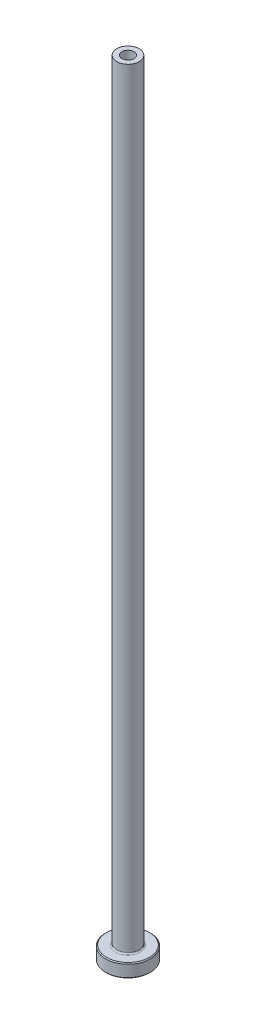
ISO-10303-21;
HEADER;
FILE_DESCRIPTION(('STEP AP214'),'2;1');
FILE_NAME('part.step','',(''),(''),'','','');
FILE_SCHEMA(('AUTOMOTIVE_DESIGN { 1 0 10303 214 1 1 1 1 }'));
ENDSEC;
DATA;
#1=APPLICATION_CONTEXT('core data for automotive mechanical design processes');
#2=APPLICATION_PROTOCOL_DEFINITION('international standard','automotive_design',2000,#1);
#3=PRODUCT_CONTEXT('',#1,'mechanical');
#4=PRODUCT('Part','Part','',(#3));
#5=PRODUCT_RELATED_PRODUCT_CATEGORY('part','',(#4));
#6=PRODUCT_DEFINITION_FORMATION('','',#4);
#7=PRODUCT_DEFINITION_CONTEXT('part definition',#1,'design');
#8=PRODUCT_DEFINITION('design','',#6,#7);
#9=PRODUCT_DEFINITION_SHAPE('','',#8);
#10=(LENGTH_UNIT() NAMED_UNIT(*) SI_UNIT(.MILLI.,.METRE.));
#11=(NAMED_UNIT(*) PLANE_ANGLE_UNIT() SI_UNIT($,.RADIAN.));
#12=(NAMED_UNIT(*) SI_UNIT($,.STERADIAN.) SOLID_ANGLE_UNIT());
#13=UNCERTAINTY_MEASURE_WITH_UNIT(LENGTH_MEASURE(1.E-05),#10,'distance_accuracy_value','');
#14=(GEOMETRIC_REPRESENTATION_CONTEXT(3) GLOBAL_UNCERTAINTY_ASSIGNED_CONTEXT((#13)) GLOBAL_UNIT_ASSIGNED_CONTEXT((#10,
#11,#12)) REPRESENTATION_CONTEXT('',''));
#15=CARTESIAN_POINT('',(0.,0.,0.));
#16=DIRECTION('',(0.,0.,1.));
#17=DIRECTION('',(1.,0.,0.));
#18=AXIS2_PLACEMENT_3D('',#15,#16,#17);
#19=CARTESIAN_POINT('',(0.,92.1876809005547,0.));
#20=DIRECTION('',(0.,1.,0.));
#21=DIRECTION('',(0.,0.,1.));
#22=AXIS2_PLACEMENT_3D('',#19,#20,#21);
#23=CYLINDRICAL_SURFACE('',#22,1.35);
#24=CARTESIAN_POINT('',(0.,175.,0.));
#25=DIRECTION('',(0.,1.,0.));
#26=DIRECTION('',(0.,0.,1.));
#27=AXIS2_PLACEMENT_3D('',#24,#25,#26);
#28=CIRCLE('',#27,1.35);
#29=CARTESIAN_POINT('',(0.,175.,1.35));
#30=VERTEX_POINT('',#29);
#31=EDGE_CURVE('E62',#30,#30,#28,.T.);
#32=ORIENTED_EDGE('',*,*,#31,.T.);
#33=EDGE_LOOP('',(#32));
#34=FACE_BOUND('',#33,.T.);
#35=CARTESIAN_POINT('',(0.,130.,0.));
#36=DIRECTION('',(0.,1.,0.));
#37=DIRECTION('',(0.,0.,1.));
#38=AXIS2_PLACEMENT_3D('',#35,#36,#37);
#39=CIRCLE('',#38,1.35);
#40=CARTESIAN_POINT('',(0.,130.,1.35));
#41=VERTEX_POINT('',#40);
#42=EDGE_CURVE('E71',#41,#41,#39,.T.);
#43=ORIENTED_EDGE('',*,*,#42,.F.);
#44=EDGE_LOOP('',(#43));
#45=FACE_BOUND('',#44,.T.);
#46=ADVANCED_FACE('F30',(#34,#45),#23,.F.);
#47=CARTESIAN_POINT('',(-1.35,175.,0.));
#48=DIRECTION('',(0.,1.,0.));
#49=DIRECTION('',(0.,0.,1.));
#50=AXIS2_PLACEMENT_3D('',#47,#48,#49);
#51=PLANE('',#50);
#52=CARTESIAN_POINT('',(0.,175.,0.));
#53=DIRECTION('',(0.,1.,0.));
#54=DIRECTION('',(0.,0.,1.));
#55=AXIS2_PLACEMENT_3D('',#52,#53,#54);
#56=CIRCLE('',#55,2.50000000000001);
#57=CARTESIAN_POINT('',(0.,175.,2.50000000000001));
#58=VERTEX_POINT('',#57);
#59=EDGE_CURVE('E65',#58,#58,#56,.T.);
#60=ORIENTED_EDGE('',*,*,#59,.T.);
#61=EDGE_LOOP('',(#60));
#62=FACE_BOUND('',#61,.T.);
#63=ORIENTED_EDGE('',*,*,#31,.F.);
#64=EDGE_LOOP('',(#63));
#65=FACE_BOUND('',#64,.T.);
#66=ADVANCED_FACE('F79',(#62,#65),#51,.T.);
#67=CARTESIAN_POINT('',(0.,92.1876809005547,0.));
#68=DIRECTION('',(0.,1.,0.));
#69=DIRECTION('',(0.,0.,1.));
#70=AXIS2_PLACEMENT_3D('',#67,#68,#69);
#71=CYLINDRICAL_SURFACE('',#70,2.5);
#72=CARTESIAN_POINT('',(0.,3.3,0.));
#73=DIRECTION('',(0.,1.,0.));
#74=DIRECTION('',(0.,0.,1.));
#75=AXIS2_PLACEMENT_3D('',#72,#73,#74);
#76=CIRCLE('',#75,2.5);
#77=CARTESIAN_POINT('',(0.,3.3,2.5));
#78=VERTEX_POINT('',#77);
#79=EDGE_CURVE('E59',#78,#78,#76,.T.);
#80=ORIENTED_EDGE('',*,*,#79,.T.);
#81=EDGE_LOOP('',(#80));
#82=FACE_BOUND('',#81,.T.);
#83=ORIENTED_EDGE('',*,*,#59,.F.);
#84=EDGE_LOOP('',(#83));
#85=FACE_BOUND('',#84,.T.);
#86=ADVANCED_FACE('F85',(#82,#85),#71,.T.);
#87=CARTESIAN_POINT('',(-2.49999999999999,3.,0.));
#88=DIRECTION('',(0.,1.,0.));
#89=DIRECTION('',(0.,0.,1.));
#90=AXIS2_PLACEMENT_3D('',#87,#88,#89);
#91=PLANE('',#90);
#92=CARTESIAN_POINT('',(0.,3.,0.));
#93=DIRECTION('',(0.,1.,0.));
#94=DIRECTION('',(0.,0.,1.));
#95=AXIS2_PLACEMENT_3D('',#92,#93,#94);
#96=CIRCLE('',#95,4.8);
#97=CARTESIAN_POINT('',(0.,3.,4.8));
#98=VERTEX_POINT('',#97);
#99=EDGE_CURVE('E53',#98,#98,#96,.T.);
#100=ORIENTED_EDGE('',*,*,#99,.T.);
#101=EDGE_LOOP('',(#100));
#102=FACE_BOUND('',#101,.T.);
#103=CARTESIAN_POINT('',(0.,3.,0.));
#104=DIRECTION('',(0.,1.,0.));
#105=DIRECTION('',(0.,0.,1.));
#106=AXIS2_PLACEMENT_3D('',#103,#104,#105);
#107=CIRCLE('',#106,2.8);
#108=CARTESIAN_POINT('',(0.,3.,2.8));
#109=VERTEX_POINT('',#108);
#110=EDGE_CURVE('E56',#109,#109,#107,.F.);
#111=ORIENTED_EDGE('',*,*,#110,.T.);
#112=EDGE_LOOP('',(#111));
#113=FACE_BOUND('',#112,.T.);
#114=ADVANCED_FACE('F111',(#102,#113),#91,.T.);
#115=CARTESIAN_POINT('',(0.,92.1876809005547,0.));
#116=DIRECTION('',(0.,1.,0.));
#117=DIRECTION('',(0.,0.,1.));
#118=AXIS2_PLACEMENT_3D('',#115,#116,#117);
#119=CYLINDRICAL_SURFACE('',#118,4.99999999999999);
#120=CARTESIAN_POINT('',(0.,2.8,0.));
#121=DIRECTION('',(0.,1.,0.));
#122=DIRECTION('',(0.,0.,1.));
#123=AXIS2_PLACEMENT_3D('',#120,#121,#122);
#124=CIRCLE('',#123,4.99999999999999);
#125=CARTESIAN_POINT('',(0.,2.8,4.99999999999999));
#126=VERTEX_POINT('',#125);
#127=EDGE_CURVE('E45',#126,#126,#124,.F.);
#128=ORIENTED_EDGE('',*,*,#127,.T.);
#129=EDGE_LOOP('',(#128));
#130=FACE_BOUND('',#129,.T.);
#131=CARTESIAN_POINT('',(0.,0.200000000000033,0.));
#132=DIRECTION('',(0.,-1.,0.));
#133=DIRECTION('',(0.,0.,-1.));
#134=AXIS2_PLACEMENT_3D('',#131,#132,#133);
#135=CIRCLE('',#134,4.99999999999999);
#136=CARTESIAN_POINT('',(0.,0.200000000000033,-4.99999999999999));
#137=VERTEX_POINT('',#136);
#138=EDGE_CURVE('E50',#137,#137,#135,.F.);
#139=ORIENTED_EDGE('',*,*,#138,.T.);
#140=EDGE_LOOP('',(#139));
#141=FACE_BOUND('',#140,.T.);
#142=ADVANCED_FACE('F108',(#130,#141),#119,.T.);
#143=CARTESIAN_POINT('',(-4.99999999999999,0.,0.));
#144=DIRECTION('',(0.,-1.,0.));
#145=DIRECTION('',(0.,0.,-1.));
#146=AXIS2_PLACEMENT_3D('',#143,#144,#145);
#147=PLANE('',#146);
#148=CARTESIAN_POINT('',(0.,0.,0.));
#149=DIRECTION('',(0.,-1.,0.));
#150=DIRECTION('',(0.,0.,-1.));
#151=AXIS2_PLACEMENT_3D('',#148,#149,#150);
#152=CIRCLE('',#151,2.09999999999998);
#153=CARTESIAN_POINT('',(0.,0.,-2.09999999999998));
#154=VERTEX_POINT('',#153);
#155=EDGE_CURVE('E37',#154,#154,#152,.F.);
#156=ORIENTED_EDGE('',*,*,#155,.T.);
#157=EDGE_LOOP('',(#156));
#158=FACE_BOUND('',#157,.T.);
#159=CARTESIAN_POINT('',(0.,0.,0.));
#160=DIRECTION('',(0.,-1.,0.));
#161=DIRECTION('',(0.,0.,-1.));
#162=AXIS2_PLACEMENT_3D('',#159,#160,#161);
#163=CIRCLE('',#162,4.79999999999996);
#164=CARTESIAN_POINT('',(0.,0.,-4.79999999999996));
#165=VERTEX_POINT('',#164);
#166=EDGE_CURVE('E41',#165,#165,#163,.T.);
#167=ORIENTED_EDGE('',*,*,#166,.T.);
#168=EDGE_LOOP('',(#167));
#169=FACE_BOUND('',#168,.T.);
#170=ADVANCED_FACE('F110',(#158,#169),#147,.T.);
#171=CARTESIAN_POINT('',(0.,92.1876809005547,0.));
#172=DIRECTION('',(0.,1.,0.));
#173=DIRECTION('',(0.,0.,1.));
#174=AXIS2_PLACEMENT_3D('',#171,#172,#173);
#175=CYLINDRICAL_SURFACE('',#174,1.6);
#176=CARTESIAN_POINT('',(0.,0.499999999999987,0.));
#177=DIRECTION('',(0.,-1.,0.));
#178=DIRECTION('',(0.,0.,-1.));
#179=AXIS2_PLACEMENT_3D('',#176,#177,#178);
#180=CIRCLE('',#179,1.6);
#181=CARTESIAN_POINT('',(0.,0.499999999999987,-1.6));
#182=VERTEX_POINT('',#181);
#183=EDGE_CURVE('E10',#182,#182,#180,.T.);
#184=ORIENTED_EDGE('',*,*,#183,.T.);
#185=EDGE_LOOP('',(#184));
#186=FACE_BOUND('',#185,.T.);
#187=CARTESIAN_POINT('',(0.,118.,0.));
#188=DIRECTION('',(0.,1.,0.));
#189=DIRECTION('',(0.,0.,1.));
#190=AXIS2_PLACEMENT_3D('',#187,#188,#189);
#191=CIRCLE('',#190,1.6);
#192=CARTESIAN_POINT('',(0.,118.,1.6));
#193=VERTEX_POINT('',#192);
#194=EDGE_CURVE('E68',#193,#193,#191,.T.);
#195=ORIENTED_EDGE('',*,*,#194,.T.);
#196=EDGE_LOOP('',(#195));
#197=FACE_BOUND('',#196,.T.);
#198=ADVANCED_FACE('F118',(#186,#197),#175,.F.);
#199=CARTESIAN_POINT('',(0.,118.,0.));
#200=DIRECTION('',(0.,-1.,0.));
#201=DIRECTION('',(0.,0.,-1.));
#202=AXIS2_PLACEMENT_3D('',#199,#200,#201);
#203=CONICAL_SURFACE('',#202,1.6,0.0208303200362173);
#204=ORIENTED_EDGE('',*,*,#42,.T.);
#205=EDGE_LOOP('',(#204));
#206=FACE_BOUND('',#205,.T.);
#207=ORIENTED_EDGE('',*,*,#194,.F.);
#208=EDGE_LOOP('',(#207));
#209=FACE_BOUND('',#208,.T.);
#210=ADVANCED_FACE('F75',(#206,#209),#203,.F.);
#211=CARTESIAN_POINT('',(0.,3.3,0.));
#212=DIRECTION('',(0.,1.,0.));
#213=DIRECTION('',(0.,0.,1.));
#214=AXIS2_PLACEMENT_3D('',#211,#212,#213);
#215=TOROIDAL_SURFACE('',#214,2.8,0.3);
#216=ORIENTED_EDGE('',*,*,#110,.F.);
#217=EDGE_LOOP('',(#216));
#218=FACE_BOUND('',#217,.T.);
#219=ORIENTED_EDGE('',*,*,#79,.F.);
#220=EDGE_LOOP('',(#219));
#221=FACE_BOUND('',#220,.T.);
#222=ADVANCED_FACE('F90',(#218,#221),#215,.F.);
#223=CARTESIAN_POINT('',(0.,3.,0.));
#224=DIRECTION('',(0.,-1.,0.));
#225=DIRECTION('',(0.,0.,-1.));
#226=AXIS2_PLACEMENT_3D('',#223,#224,#225);
#227=CONICAL_SURFACE('',#226,4.8,0.785398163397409);
#228=ORIENTED_EDGE('',*,*,#127,.F.);
#229=EDGE_LOOP('',(#228));
#230=FACE_BOUND('',#229,.T.);
#231=ORIENTED_EDGE('',*,*,#99,.F.);
#232=EDGE_LOOP('',(#231));
#233=FACE_BOUND('',#232,.T.);
#234=ADVANCED_FACE('F93',(#230,#233),#227,.T.);
#235=CARTESIAN_POINT('',(0.,0.200000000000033,0.));
#236=DIRECTION('',(0.,1.,0.));
#237=DIRECTION('',(0.,0.,1.));
#238=AXIS2_PLACEMENT_3D('',#235,#236,#237);
#239=CONICAL_SURFACE('',#238,4.99999999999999,0.785398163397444);
#240=ORIENTED_EDGE('',*,*,#166,.F.);
#241=EDGE_LOOP('',(#240));
#242=FACE_BOUND('',#241,.T.);
#243=ORIENTED_EDGE('',*,*,#138,.F.);
#244=EDGE_LOOP('',(#243));
#245=FACE_BOUND('',#244,.T.);
#246=ADVANCED_FACE('F96',(#242,#245),#239,.T.);
#247=CARTESIAN_POINT('',(0.,0.,0.));
#248=DIRECTION('',(0.,-1.,0.));
#249=DIRECTION('',(0.,0.,-1.));
#250=AXIS2_PLACEMENT_3D('',#247,#248,#249);
#251=CONICAL_SURFACE('',#250,2.09999999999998,0.785398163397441);
#252=ORIENTED_EDGE('',*,*,#183,.F.);
#253=EDGE_LOOP('',(#252));
#254=FACE_BOUND('',#253,.T.);
#255=ORIENTED_EDGE('',*,*,#155,.F.);
#256=EDGE_LOOP('',(#255));
#257=FACE_BOUND('',#256,.T.);
#258=ADVANCED_FACE('F32',(#254,#257),#251,.F.);
#259=CLOSED_SHELL('',(#46,#66,#86,#114,#142,#170,#198,#210,#222,#234,#246,#258));
#260=MANIFOLD_SOLID_BREP('B2',#259);
#261=ADVANCED_BREP_SHAPE_REPRESENTATION('',(#18,#260),#14);
#262=SHAPE_DEFINITION_REPRESENTATION(#9,#261);
ENDSEC;
END-ISO-10303-21;
